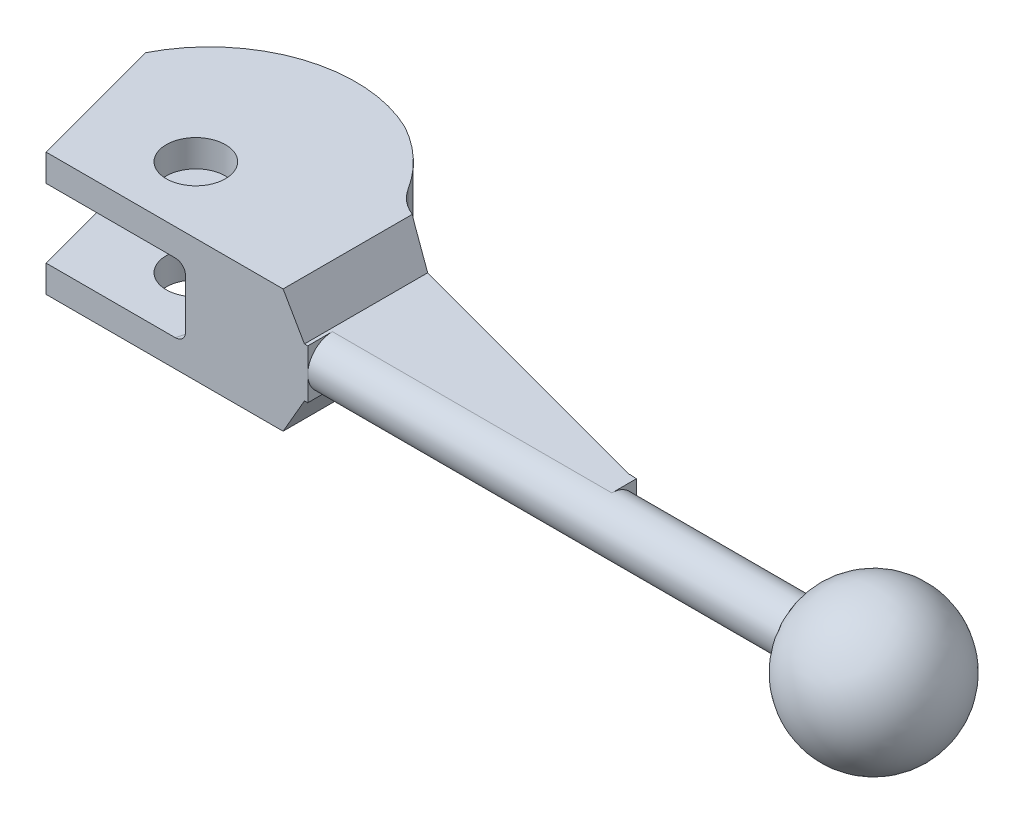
ISO-10303-21;
HEADER;
FILE_DESCRIPTION(('STEP AP214'),'2;1');
FILE_NAME('part.step','',(''),(''),'','','');
FILE_SCHEMA(('AUTOMOTIVE_DESIGN { 1 0 10303 214 1 1 1 1 }'));
ENDSEC;
DATA;
#1=APPLICATION_CONTEXT('core data for automotive mechanical design processes');
#2=APPLICATION_PROTOCOL_DEFINITION('international standard','automotive_design',2000,#1);
#3=PRODUCT_CONTEXT('',#1,'mechanical');
#4=PRODUCT('Part','Part','',(#3));
#5=PRODUCT_RELATED_PRODUCT_CATEGORY('part','',(#4));
#6=PRODUCT_DEFINITION_FORMATION('','',#4);
#7=PRODUCT_DEFINITION_CONTEXT('part definition',#1,'design');
#8=PRODUCT_DEFINITION('design','',#6,#7);
#9=PRODUCT_DEFINITION_SHAPE('','',#8);
#10=(LENGTH_UNIT() NAMED_UNIT(*) SI_UNIT(.MILLI.,.METRE.));
#11=(NAMED_UNIT(*) PLANE_ANGLE_UNIT() SI_UNIT($,.RADIAN.));
#12=(NAMED_UNIT(*) SI_UNIT($,.STERADIAN.) SOLID_ANGLE_UNIT());
#13=UNCERTAINTY_MEASURE_WITH_UNIT(LENGTH_MEASURE(1.E-05),#10,'distance_accuracy_value','');
#14=(GEOMETRIC_REPRESENTATION_CONTEXT(3) GLOBAL_UNCERTAINTY_ASSIGNED_CONTEXT((#13)) GLOBAL_UNIT_ASSIGNED_CONTEXT((#10,
#11,#12)) REPRESENTATION_CONTEXT('',''));
#15=CARTESIAN_POINT('',(0.,0.,0.));
#16=DIRECTION('',(0.,0.,1.));
#17=DIRECTION('',(1.,0.,0.));
#18=AXIS2_PLACEMENT_3D('',#15,#16,#17);
#19=CARTESIAN_POINT('',(-1.40946282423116E-13,-12.5,0.));
#20=DIRECTION('',(0.,-1.,0.));
#21=DIRECTION('',(1.,0.,0.));
#22=AXIS2_PLACEMENT_3D('',#19,#20,#21);
#23=CYLINDRICAL_SURFACE('',#22,6.);
#24=CARTESIAN_POINT('',(0.,-7.,0.));
#25=DIRECTION('',(0.,-1.,0.));
#26=DIRECTION('',(1.,0.,0.));
#27=AXIS2_PLACEMENT_3D('',#24,#25,#26);
#28=CIRCLE('',#27,6.);
#29=CARTESIAN_POINT('',(5.99999999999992,-7.00000000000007,0.));
#30=VERTEX_POINT('',#29);
#31=EDGE_CURVE('E198',#30,#30,#28,.T.);
#32=ORIENTED_EDGE('',*,*,#31,.F.);
#33=EDGE_LOOP('',(#32));
#34=FACE_BOUND('',#33,.T.);
#35=CARTESIAN_POINT('',(-1.40946282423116E-13,-12.5,0.));
#36=DIRECTION('',(0.,-1.,0.));
#37=DIRECTION('',(1.,0.,0.));
#38=AXIS2_PLACEMENT_3D('',#35,#36,#37);
#39=CIRCLE('',#38,6.);
#40=CARTESIAN_POINT('',(5.99999999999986,-12.5000000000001,0.));
#41=VERTEX_POINT('',#40);
#42=EDGE_CURVE('E17',#41,#41,#39,.F.);
#43=ORIENTED_EDGE('',*,*,#42,.F.);
#44=EDGE_LOOP('',(#43));
#45=FACE_BOUND('',#44,.T.);
#46=ADVANCED_FACE('F14',(#34,#45),#23,.F.);
#47=CARTESIAN_POINT('',(2.19999999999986,-12.5,-0.55000000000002));
#48=DIRECTION('',(0.,-1.,0.));
#49=DIRECTION('',(1.,0.,0.));
#50=AXIS2_PLACEMENT_3D('',#47,#48,#49);
#51=CYLINDRICAL_SURFACE('',#50,29.7);
#52=CARTESIAN_POINT('',(2.19999999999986,-12.5,-0.55000000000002));
#53=DIRECTION('',(0.,-1.,0.));
#54=DIRECTION('',(1.,0.,0.));
#55=AXIS2_PLACEMENT_3D('',#52,#53,#54);
#56=CIRCLE('',#55,29.7);
#57=CARTESIAN_POINT('',(-24.27,-12.4999999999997,-14.0195619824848));
#58=VERTEX_POINT('',#57);
#59=CARTESIAN_POINT('',(15.1051904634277,-12.5000000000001,-27.2996926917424));
#60=VERTEX_POINT('',#59);
#61=EDGE_CURVE('E187',#58,#60,#56,.T.);
#62=ORIENTED_EDGE('',*,*,#61,.F.);
#63=DIRECTION('',(0.,-1.,0.));
#64=VECTOR('',#63,1.);
#65=CARTESIAN_POINT('',(-24.27,-12.4999999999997,-14.0195619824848));
#66=LINE('',#65,#64);
#67=CARTESIAN_POINT('',(-24.27,-6.9999999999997,-14.0195619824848));
#68=VERTEX_POINT('',#67);
#69=EDGE_CURVE('E191',#68,#58,#66,.T.);
#70=ORIENTED_EDGE('',*,*,#69,.F.);
#71=CARTESIAN_POINT('',(2.19999999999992,-7.,-0.55000000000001));
#72=DIRECTION('',(0.,-1.,0.));
#73=DIRECTION('',(1.,0.,0.));
#74=AXIS2_PLACEMENT_3D('',#71,#72,#73);
#75=CIRCLE('',#74,29.7);
#76=CARTESIAN_POINT('',(15.1051904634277,-7.00000000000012,-27.2996926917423));
#77=VERTEX_POINT('',#76);
#78=EDGE_CURVE('E204',#77,#68,#75,.F.);
#79=ORIENTED_EDGE('',*,*,#78,.F.);
#80=DIRECTION('',(0.,-1.,0.));
#81=VECTOR('',#80,1.);
#82=CARTESIAN_POINT('',(15.1051904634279,-12.5000000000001,-27.2996926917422));
#83=LINE('',#82,#81);
#84=EDGE_CURVE('E177',#60,#77,#83,.F.);
#85=ORIENTED_EDGE('',*,*,#84,.F.);
#86=EDGE_LOOP('',(#62,#70,#79,#85));
#87=FACE_BOUND('',#86,.T.);
#88=ADVANCED_FACE('F241',(#87),#51,.T.);
#89=CARTESIAN_POINT('',(-1.40946282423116E-13,-12.5,0.));
#90=DIRECTION('',(0.,-1.,0.));
#91=DIRECTION('',(1.,0.,0.));
#92=AXIS2_PLACEMENT_3D('',#89,#90,#91);
#93=CYLINDRICAL_SURFACE('',#92,6.);
#94=CARTESIAN_POINT('',(0.,7.,0.));
#95=DIRECTION('',(0.,-1.,0.));
#96=DIRECTION('',(1.,0.,0.));
#97=AXIS2_PLACEMENT_3D('',#94,#95,#96);
#98=CIRCLE('',#97,6.);
#99=CARTESIAN_POINT('',(6.00000000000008,6.99999999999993,0.));
#100=VERTEX_POINT('',#99);
#101=EDGE_CURVE('E421',#100,#100,#98,.F.);
#102=ORIENTED_EDGE('',*,*,#101,.F.);
#103=EDGE_LOOP('',(#102));
#104=FACE_BOUND('',#103,.T.);
#105=CARTESIAN_POINT('',(1.40946282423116E-13,12.5,0.));
#106=DIRECTION('',(0.,-1.,0.));
#107=DIRECTION('',(1.,0.,0.));
#108=AXIS2_PLACEMENT_3D('',#105,#106,#107);
#109=CIRCLE('',#108,6.);
#110=CARTESIAN_POINT('',(6.00000000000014,12.4999999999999,0.));
#111=VERTEX_POINT('',#110);
#112=EDGE_CURVE('E339',#111,#111,#109,.F.);
#113=ORIENTED_EDGE('',*,*,#112,.T.);
#114=EDGE_LOOP('',(#113));
#115=FACE_BOUND('',#114,.T.);
#116=ADVANCED_FACE('F238',(#104,#115),#93,.F.);
#117=CARTESIAN_POINT('',(2.19999999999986,-12.5,-0.55000000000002));
#118=DIRECTION('',(0.,-1.,0.));
#119=DIRECTION('',(1.,0.,0.));
#120=AXIS2_PLACEMENT_3D('',#117,#118,#119);
#121=CYLINDRICAL_SURFACE('',#120,29.7);
#122=CARTESIAN_POINT('',(2.20000000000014,12.5,-0.549999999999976));
#123=DIRECTION('',(0.,-1.,0.));
#124=DIRECTION('',(1.,0.,0.));
#125=AXIS2_PLACEMENT_3D('',#122,#123,#124);
#126=CIRCLE('',#125,29.7);
#127=CARTESIAN_POINT('',(-24.27,12.5000000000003,-14.0195619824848));
#128=VERTEX_POINT('',#127);
#129=CARTESIAN_POINT('',(15.1051904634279,12.4999999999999,-27.2996926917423));
#130=VERTEX_POINT('',#129);
#131=EDGE_CURVE('E338',#128,#130,#126,.T.);
#132=ORIENTED_EDGE('',*,*,#131,.T.);
#133=DIRECTION('',(0.,-1.,0.));
#134=VECTOR('',#133,1.);
#135=CARTESIAN_POINT('',(15.1051904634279,-12.5000000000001,-27.2996926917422));
#136=LINE('',#135,#134);
#137=CARTESIAN_POINT('',(15.1051904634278,6.99999999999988,-27.2996926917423));
#138=VERTEX_POINT('',#137);
#139=EDGE_CURVE('E379',#138,#130,#136,.F.);
#140=ORIENTED_EDGE('',*,*,#139,.F.);
#141=CARTESIAN_POINT('',(2.20000000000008,7.,-0.549999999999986));
#142=DIRECTION('',(0.,-1.,0.));
#143=DIRECTION('',(1.,0.,0.));
#144=AXIS2_PLACEMENT_3D('',#141,#142,#143);
#145=CIRCLE('',#144,29.7);
#146=CARTESIAN_POINT('',(-24.27,7.0000000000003,-14.0195619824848));
#147=VERTEX_POINT('',#146);
#148=EDGE_CURVE('E419',#147,#138,#145,.T.);
#149=ORIENTED_EDGE('',*,*,#148,.F.);
#150=DIRECTION('',(0.,-1.,0.));
#151=VECTOR('',#150,1.);
#152=CARTESIAN_POINT('',(-24.27,-12.4999999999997,-14.0195619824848));
#153=LINE('',#152,#151);
#154=EDGE_CURVE('E344',#128,#147,#153,.T.);
#155=ORIENTED_EDGE('',*,*,#154,.F.);
#156=EDGE_LOOP('',(#132,#140,#149,#155));
#157=FACE_BOUND('',#156,.T.);
#158=ADVANCED_FACE('F233',(#157),#121,.T.);
#159=CARTESIAN_POINT('',(-2.31151903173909E-13,-12.5,0.));
#160=DIRECTION('',(0.,-1.,0.));
#161=DIRECTION('',(1.,0.,0.));
#162=AXIS2_PLACEMENT_3D('',#159,#160,#161);
#163=CYLINDRICAL_SURFACE('',#162,31.2);
#164=DIRECTION('',(0.,-1.,0.));
#165=VECTOR('',#164,1.);
#166=CARTESIAN_POINT('',(21.1560318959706,-5.0000000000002,-22.9316879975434));
#167=LINE('',#166,#165);
#168=CARTESIAN_POINT('',(21.1560318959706,4.9999999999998,-22.9316879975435));
#169=VERTEX_POINT('',#168);
#170=CARTESIAN_POINT('',(21.1560318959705,-5.0000000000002,-22.9316879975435));
#171=VERTEX_POINT('',#170);
#172=EDGE_CURVE('E216',#169,#171,#167,.T.);
#173=ORIENTED_EDGE('',*,*,#172,.F.);
#174=CARTESIAN_POINT('',(21.1560318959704,4.9999999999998,-22.9316879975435));
#175=CARTESIAN_POINT('',(21.1560385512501,5.05183249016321,-22.9316804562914));
#176=CARTESIAN_POINT('',(21.1543594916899,5.1036599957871,-22.9332308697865));
#177=CARTESIAN_POINT('',(21.147681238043,5.20690174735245,-22.9393900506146));
#178=CARTESIAN_POINT('',(21.1426831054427,5.25831612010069,-22.9439978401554));
#179=CARTESIAN_POINT('',(21.1294444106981,5.36015831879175,-22.9561899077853));
#180=CARTESIAN_POINT('',(21.1212168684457,5.41058926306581,-22.9637622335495));
#181=CARTESIAN_POINT('',(21.1016214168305,5.51030443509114,-22.9817699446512));
#182=CARTESIAN_POINT('',(21.0902533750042,5.55958861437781,-22.992205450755));
#183=CARTESIAN_POINT('',(21.0516309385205,5.70513129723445,-23.0275935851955));
#184=CARTESIAN_POINT('',(21.0198346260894,5.79925819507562,-23.0566497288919));
#185=CARTESIAN_POINT('',(20.9453858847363,5.97941643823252,-23.1243016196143));
#186=CARTESIAN_POINT('',(20.902724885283,6.0654413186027,-23.1629048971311));
#187=CARTESIAN_POINT('',(20.8055990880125,6.23180120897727,-23.2501936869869));
#188=CARTESIAN_POINT('',(20.7506538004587,6.31164241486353,-23.2992842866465));
#189=CARTESIAN_POINT('',(20.6320026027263,6.45929734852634,-23.4044173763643));
#190=CARTESIAN_POINT('',(20.5682939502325,6.52710729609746,-23.4604620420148));
#191=CARTESIAN_POINT('',(20.426426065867,6.65642617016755,-23.5841233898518));
#192=CARTESIAN_POINT('',(20.3474494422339,6.71646878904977,-23.6523362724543));
#193=CARTESIAN_POINT('',(20.182685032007,6.81986067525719,-23.7930871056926));
#194=CARTESIAN_POINT('',(20.0968938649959,6.86320159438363,-23.8656271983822));
#195=CARTESIAN_POINT('',(19.9226868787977,6.93166799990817,-24.0112270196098));
#196=CARTESIAN_POINT('',(19.8343898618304,6.95722077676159,-24.0842286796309));
#197=CARTESIAN_POINT('',(19.6551473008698,6.99138834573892,-24.230742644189));
#198=CARTESIAN_POINT('',(19.5642046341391,7.0000208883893,-24.3042543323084));
#199=CARTESIAN_POINT('',(19.4728125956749,6.99999999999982,-24.3772346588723));
#200=B_SPLINE_CURVE_WITH_KNOTS('',3,(#174,#175,#176,#177,#178,#179,#180,#181,#182,#183,#184,
#185,#186,#187,#188,#189,#190,#191,#192,#193,#194,#195,#196,#197,#198,#199),.UNSPECIFIED.,.F.,
.F.,(4,2,2,2,2,2,2,2,2,2,2,2,4),(0.,0.155438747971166,0.310827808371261,0.465596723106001,
0.620372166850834,0.92938655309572,1.23864546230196,1.56324256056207,1.88794146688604,
2.24762815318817,2.60749439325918,2.95838656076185,3.3089104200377),.UNSPECIFIED.);
#201=CARTESIAN_POINT('',(19.4728125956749,6.99999999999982,-24.3772346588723));
#202=VERTEX_POINT('',#201);
#203=EDGE_CURVE('E218',#169,#202,#200,.T.);
#204=ORIENTED_EDGE('',*,*,#203,.T.);
#205=CARTESIAN_POINT('',(0.,7.,1.196959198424E-13));
#206=DIRECTION('',(0.,-1.,0.));
#207=DIRECTION('',(1.,0.,0.));
#208=AXIS2_PLACEMENT_3D('',#205,#206,#207);
#209=CIRCLE('',#208,31.2);
#210=EDGE_CURVE('E348',#138,#202,#209,.T.);
#211=ORIENTED_EDGE('',*,*,#210,.F.);
#212=ORIENTED_EDGE('',*,*,#139,.T.);
#213=CARTESIAN_POINT('',(0.,12.5,1.29236898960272E-13));
#214=DIRECTION('',(0.,-1.,0.));
#215=DIRECTION('',(1.,0.,0.));
#216=AXIS2_PLACEMENT_3D('',#213,#214,#215);
#217=CIRCLE('',#216,31.2);
#218=CARTESIAN_POINT('',(26.3585970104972,12.4999999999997,-16.6932430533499));
#219=VERTEX_POINT('',#218);
#220=EDGE_CURVE('E173',#130,#219,#217,.T.);
#221=ORIENTED_EDGE('',*,*,#220,.T.);
#222=DIRECTION('',(0.,-1.,0.));
#223=VECTOR('',#222,1.);
#224=CARTESIAN_POINT('',(26.358597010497,-12.5000000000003,-16.6932430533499));
#225=LINE('',#224,#223);
#226=CARTESIAN_POINT('',(26.358597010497,-12.5000000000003,-16.6932430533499));
#227=VERTEX_POINT('',#226);
#228=EDGE_CURVE('E165',#219,#227,#225,.T.);
#229=ORIENTED_EDGE('',*,*,#228,.T.);
#230=CARTESIAN_POINT('',(-2.31151903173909E-13,-12.5,0.));
#231=DIRECTION('',(0.,-1.,0.));
#232=DIRECTION('',(1.,0.,0.));
#233=AXIS2_PLACEMENT_3D('',#230,#231,#232);
#234=CIRCLE('',#233,31.2);
#235=EDGE_CURVE('E169',#60,#227,#234,.T.);
#236=ORIENTED_EDGE('',*,*,#235,.F.);
#237=ORIENTED_EDGE('',*,*,#84,.T.);
#238=CARTESIAN_POINT('',(-1.69135538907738E-13,-7.,0.));
#239=DIRECTION('',(0.,-1.,0.));
#240=DIRECTION('',(1.,0.,0.));
#241=AXIS2_PLACEMENT_3D('',#238,#239,#240);
#242=CIRCLE('',#241,31.2);
#243=CARTESIAN_POINT('',(19.4728125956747,-7.00000000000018,-24.3772346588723));
#244=VERTEX_POINT('',#243);
#245=EDGE_CURVE('E201',#244,#77,#242,.F.);
#246=ORIENTED_EDGE('',*,*,#245,.F.);
#247=CARTESIAN_POINT('',(19.4728125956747,-7.00000000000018,-24.3772346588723));
#248=CARTESIAN_POINT('',(19.5773904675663,-7.00003593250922,-24.2937387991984));
#249=CARTESIAN_POINT('',(19.6813743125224,-6.98872538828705,-24.2095323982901));
#250=CARTESIAN_POINT('',(19.8855567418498,-6.94404516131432,-24.0420786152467));
#251=CARTESIAN_POINT('',(19.9857496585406,-6.91064372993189,-23.9588327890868));
#252=CARTESIAN_POINT('',(20.179502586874,-6.82238887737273,-23.795879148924));
#253=CARTESIAN_POINT('',(20.2730579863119,-6.76752070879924,-23.7161738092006));
#254=CARTESIAN_POINT('',(20.4506761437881,-6.6373144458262,-23.5631819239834));
#255=CARTESIAN_POINT('',(20.5347439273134,-6.56198726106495,-23.4898919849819));
#256=CARTESIAN_POINT('',(20.6879178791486,-6.39507384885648,-23.3550881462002));
#257=CARTESIAN_POINT('',(20.757430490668,-6.30411586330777,-23.2932623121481));
#258=CARTESIAN_POINT('',(20.8821061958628,-6.10633503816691,-23.1815586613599));
#259=CARTESIAN_POINT('',(20.9372749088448,-5.99951843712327,-23.1316761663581));
#260=CARTESIAN_POINT('',(21.0257578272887,-5.78448698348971,-23.0512634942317));
#261=CARTESIAN_POINT('',(21.0607163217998,-5.67750247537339,-23.0192877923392));
#262=CARTESIAN_POINT('',(21.1014015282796,-5.51198880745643,-22.9819750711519));
#263=CARTESIAN_POINT('',(21.1130015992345,-5.45600776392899,-22.9713153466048));
#264=CARTESIAN_POINT('',(21.1321610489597,-5.3427974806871,-22.9536912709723));
#265=CARTESIAN_POINT('',(21.1397229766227,-5.28556905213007,-22.9467245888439));
#266=CARTESIAN_POINT('',(21.1488120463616,-5.19017113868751,-22.9383471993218));
#267=CARTESIAN_POINT('',(21.1515196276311,-5.15220114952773,-22.9358502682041));
#268=CARTESIAN_POINT('',(21.1551288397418,-5.0761562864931,-22.9325211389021));
#269=CARTESIAN_POINT('',(21.1560329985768,-5.03808163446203,-22.9316866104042));
#270=CARTESIAN_POINT('',(21.1560318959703,-5.0000000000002,-22.9316879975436));
#271=B_SPLINE_CURVE_WITH_KNOTS('',3,(#247,#248,#249,#250,#251,#252,#253,#254,#255,#256,#257,
#258,#259,#260,#261,#262,#263,#264,#265,#266,#267,#268,#269,#270),.UNSPECIFIED.,.F.,.F.,(4,2,2,
2,2,2,2,2,2,2,2,4),(0.,0.400967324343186,0.802512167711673,1.20433335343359,1.60594068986,
1.994112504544,2.38213202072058,2.7309702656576,2.90521275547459,3.07934513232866,
3.19371696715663,3.30792836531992),.UNSPECIFIED.);
#272=EDGE_CURVE('E208',#244,#171,#271,.T.);
#273=ORIENTED_EDGE('',*,*,#272,.T.);
#274=EDGE_LOOP('',(#173,#204,#211,#212,#221,#229,#236,#237,#246,#273));
#275=FACE_BOUND('',#274,.T.);
#276=ADVANCED_FACE('F167',(#275),#163,.T.);
#277=CARTESIAN_POINT('',(34.8068652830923,-12.5000000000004,-22.0436414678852));
#278=DIRECTION('',(0.,-1.,0.));
#279=DIRECTION('',(1.,0.,0.));
#280=AXIS2_PLACEMENT_3D('',#277,#278,#279);
#281=CYLINDRICAL_SURFACE('',#280,10.);
#282=CARTESIAN_POINT('',(34.8068652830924,-6.25272607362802,-22.0436414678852));
#283=DIRECTION('',(0.866025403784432,-0.500000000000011,0.));
#284=DIRECTION('',(-0.500000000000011,-0.866025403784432,0.));
#285=AXIS2_PLACEMENT_3D('',#282,#283,#284);
#286=ELLIPSE('',#285,20.,10.);
#287=CARTESIAN_POINT('',(31.2,-12.5000000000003,-12.7167704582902));
#288=VERTEX_POINT('',#287);
#289=CARTESIAN_POINT('',(32.218674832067,-10.7356034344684,-12.3843832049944));
#290=VERTEX_POINT('',#289);
#291=EDGE_CURVE('E184',#288,#290,#286,.F.);
#292=ORIENTED_EDGE('',*,*,#291,.F.);
#293=CARTESIAN_POINT('',(34.8068652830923,-12.5000000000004,-22.0436414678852));
#294=DIRECTION('',(0.,-1.,0.));
#295=DIRECTION('',(1.,0.,0.));
#296=AXIS2_PLACEMENT_3D('',#293,#294,#295);
#297=CIRCLE('',#296,10.);
#298=EDGE_CURVE('E181',#227,#288,#297,.F.);
#299=ORIENTED_EDGE('',*,*,#298,.F.);
#300=ORIENTED_EDGE('',*,*,#228,.F.);
#301=CARTESIAN_POINT('',(34.8068652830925,12.4999999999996,-22.0436414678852));
#302=DIRECTION('',(0.,-1.,0.));
#303=DIRECTION('',(1.,0.,0.));
#304=AXIS2_PLACEMENT_3D('',#301,#302,#303);
#305=CIRCLE('',#304,10.);
#306=CARTESIAN_POINT('',(31.2,12.4999999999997,-12.7167704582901));
#307=VERTEX_POINT('',#306);
#308=EDGE_CURVE('E321',#219,#307,#305,.F.);
#309=ORIENTED_EDGE('',*,*,#308,.T.);
#310=CARTESIAN_POINT('',(34.8068652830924,6.2527260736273,-22.0436414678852));
#311=DIRECTION('',(0.866025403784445,0.49999999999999,0.));
#312=DIRECTION('',(0.49999999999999,-0.866025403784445,0.));
#313=AXIS2_PLACEMENT_3D('',#310,#311,#312);
#314=ELLIPSE('',#313,20.,10.);
#315=CARTESIAN_POINT('',(32.2186748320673,10.7356034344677,-12.3843832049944));
#316=VERTEX_POINT('',#315);
#317=EDGE_CURVE('E312',#316,#307,#314,.F.);
#318=ORIENTED_EDGE('',*,*,#317,.F.);
#319=DIRECTION('',(0.,-1.,0.));
#320=VECTOR('',#319,1.);
#321=CARTESIAN_POINT('',(32.218674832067,-12.5000000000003,-12.3843832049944));
#322=LINE('',#321,#320);
#323=EDGE_CURVE('E363',#290,#316,#322,.F.);
#324=ORIENTED_EDGE('',*,*,#323,.F.);
#325=EDGE_LOOP('',(#292,#299,#300,#309,#318,#324));
#326=FACE_BOUND('',#325,.T.);
#327=ADVANCED_FACE('F182',(#326),#281,.F.);
#328=CARTESIAN_POINT('',(91.5,-12.5000000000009,-47.7));
#329=DIRECTION('',(-1.,0.,0.));
#330=DIRECTION('',(0.,0.,-1.));
#331=AXIS2_PLACEMENT_3D('',#328,#329,#330);
#332=PLANE('',#331);
#333=DIRECTION('',(0.,0.,-1.));
#334=VECTOR('',#333,1.);
#335=CARTESIAN_POINT('',(91.5,-5.00000000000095,-47.7));
#336=LINE('',#335,#334);
#337=CARTESIAN_POINT('',(91.5,-5.00000000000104,3.40074882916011));
#338=VERTEX_POINT('',#337);
#339=CARTESIAN_POINT('',(91.5,-5.00000000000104,3.5));
#340=VERTEX_POINT('',#339);
#341=EDGE_CURVE('E375',#338,#340,#336,.F.);
#342=ORIENTED_EDGE('',*,*,#341,.T.);
#343=DIRECTION('',(0.,-1.,0.));
#344=VECTOR('',#343,1.);
#345=CARTESIAN_POINT('',(91.5,-12.500000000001,3.5));
#346=LINE('',#345,#344);
#347=CARTESIAN_POINT('',(91.5,4.99999999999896,3.5));
#348=VERTEX_POINT('',#347);
#349=EDGE_CURVE('E326',#348,#340,#346,.T.);
#350=ORIENTED_EDGE('',*,*,#349,.F.);
#351=DIRECTION('',(0.,0.,-1.));
#352=VECTOR('',#351,1.);
#353=CARTESIAN_POINT('',(91.5,4.99999999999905,-47.7));
#354=LINE('',#353,#352);
#355=CARTESIAN_POINT('',(91.5,4.99999999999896,3.40074882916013));
#356=VERTEX_POINT('',#355);
#357=EDGE_CURVE('E176',#348,#356,#354,.T.);
#358=ORIENTED_EDGE('',*,*,#357,.T.);
#359=DIRECTION('',(0.,-1.,0.));
#360=VECTOR('',#359,1.);
#361=CARTESIAN_POINT('',(91.5,-5.00000000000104,3.40074882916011));
#362=LINE('',#361,#360);
#363=EDGE_CURVE('E330',#356,#338,#362,.T.);
#364=ORIENTED_EDGE('',*,*,#363,.T.);
#365=EDGE_LOOP('',(#342,#350,#358,#364));
#366=FACE_BOUND('',#365,.T.);
#367=ADVANCED_FACE('F503',(#366),#332,.T.);
#368=CARTESIAN_POINT('',(-1.40946282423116E-13,-12.5,0.));
#369=DIRECTION('',(0.,-1.,0.));
#370=DIRECTION('',(1.,0.,0.));
#371=AXIS2_PLACEMENT_3D('',#368,#369,#370);
#372=PLANE('',#371);
#373=ORIENTED_EDGE('',*,*,#61,.T.);
#374=ORIENTED_EDGE('',*,*,#235,.T.);
#375=ORIENTED_EDGE('',*,*,#298,.T.);
#376=DIRECTION('',(0.,0.,1.));
#377=VECTOR('',#376,1.);
#378=CARTESIAN_POINT('',(31.2,-12.5000000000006,146.));
#379=LINE('',#378,#377);
#380=CARTESIAN_POINT('',(31.2,-12.5000000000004,13.5));
#381=VERTEX_POINT('',#380);
#382=EDGE_CURVE('E319',#381,#288,#379,.F.);
#383=ORIENTED_EDGE('',*,*,#382,.F.);
#384=DIRECTION('',(1.,0.,0.));
#385=VECTOR('',#384,1.);
#386=CARTESIAN_POINT('',(38.2,-12.5000000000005,13.5));
#387=LINE('',#386,#385);
#388=CARTESIAN_POINT('',(-16.8961555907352,-12.4999999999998,13.5));
#389=VERTEX_POINT('',#388);
#390=EDGE_CURVE('E325',#381,#389,#387,.F.);
#391=ORIENTED_EDGE('',*,*,#390,.T.);
#392=DIRECTION('',(-0.258819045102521,0.,-0.965925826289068));
#393=VECTOR('',#392,1.);
#394=CARTESIAN_POINT('',(-24.27,-12.4999999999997,-14.0195619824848));
#395=LINE('',#394,#393);
#396=EDGE_CURVE('E194',#58,#389,#395,.F.);
#397=ORIENTED_EDGE('',*,*,#396,.F.);
#398=EDGE_LOOP('',(#373,#374,#375,#383,#391,#397));
#399=FACE_BOUND('',#398,.T.);
#400=ORIENTED_EDGE('',*,*,#42,.T.);
#401=EDGE_LOOP('',(#400));
#402=FACE_BOUND('',#401,.T.);
#403=ADVANCED_FACE('F188',(#399,#402),#372,.T.);
#404=CARTESIAN_POINT('',(-24.27,-12.4999999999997,-14.0195619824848));
#405=DIRECTION('',(-0.965925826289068,0.,0.258819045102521));
#406=DIRECTION('',(-0.258819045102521,0.,-0.965925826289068));
#407=AXIS2_PLACEMENT_3D('',#404,#405,#406);
#408=PLANE('',#407);
#409=ORIENTED_EDGE('',*,*,#69,.T.);
#410=ORIENTED_EDGE('',*,*,#396,.T.);
#411=DIRECTION('',(0.,1.,0.));
#412=VECTOR('',#411,1.);
#413=CARTESIAN_POINT('',(-16.8961555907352,-12.4999999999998,13.5));
#414=LINE('',#413,#412);
#415=CARTESIAN_POINT('',(-16.8961555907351,-6.99999999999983,13.5));
#416=VERTEX_POINT('',#415);
#417=EDGE_CURVE('E302',#389,#416,#414,.T.);
#418=ORIENTED_EDGE('',*,*,#417,.T.);
#419=DIRECTION('',(0.258819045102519,0.,0.965925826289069));
#420=VECTOR('',#419,1.);
#421=CARTESIAN_POINT('',(-24.27,-6.9999999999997,-14.0195619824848));
#422=LINE('',#421,#420);
#423=EDGE_CURVE('E207',#68,#416,#422,.T.);
#424=ORIENTED_EDGE('',*,*,#423,.F.);
#425=EDGE_LOOP('',(#409,#410,#418,#424));
#426=FACE_BOUND('',#425,.T.);
#427=ADVANCED_FACE('F457',(#426),#408,.T.);
#428=CARTESIAN_POINT('',(-164.806826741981,-6.99999999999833,106.990466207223));
#429=DIRECTION('',(0.,1.,0.));
#430=DIRECTION('',(-1.,0.,0.));
#431=AXIS2_PLACEMENT_3D('',#428,#429,#430);
#432=PLANE('',#431);
#433=ORIENTED_EDGE('',*,*,#78,.T.);
#434=ORIENTED_EDGE('',*,*,#423,.T.);
#435=DIRECTION('',(1.,0.,0.));
#436=VECTOR('',#435,1.);
#437=CARTESIAN_POINT('',(38.2,-7.00000000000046,13.5));
#438=LINE('',#437,#436);
#439=CARTESIAN_POINT('',(9.32363815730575,-7.00000000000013,13.5));
#440=VERTEX_POINT('',#439);
#441=EDGE_CURVE('E300',#416,#440,#438,.T.);
#442=ORIENTED_EDGE('',*,*,#441,.T.);
#443=DIRECTION('',(-0.258819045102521,0.,0.965925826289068));
#444=VECTOR('',#443,1.);
#445=CARTESIAN_POINT('',(-25.7135077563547,-7.,144.260408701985));
#446=LINE('',#445,#444);
#447=EDGE_CURVE('E217',#440,#244,#446,.F.);
#448=ORIENTED_EDGE('',*,*,#447,.T.);
#449=ORIENTED_EDGE('',*,*,#245,.T.);
#450=EDGE_LOOP('',(#433,#434,#442,#448,#449));
#451=FACE_BOUND('',#450,.T.);
#452=ORIENTED_EDGE('',*,*,#31,.T.);
#453=EDGE_LOOP('',(#452));
#454=FACE_BOUND('',#453,.T.);
#455=ADVANCED_FACE('F465',(#451,#454),#432,.T.);
#456=CARTESIAN_POINT('',(-25.7135077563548,-5.,144.260408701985));
#457=DIRECTION('',(-0.258819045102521,0.,0.965925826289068));
#458=DIRECTION('',(-0.965925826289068,0.,-0.258819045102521));
#459=AXIS2_PLACEMENT_3D('',#456,#457,#458);
#460=CYLINDRICAL_SURFACE('',#459,2.);
#461=DIRECTION('',(0.258819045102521,0.,-0.965925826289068));
#462=VECTOR('',#461,1.);
#463=CARTESIAN_POINT('',(-23.7816561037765,-5.,144.778046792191));
#464=LINE('',#463,#462);
#465=CARTESIAN_POINT('',(11.394190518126,-5.00000000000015,13.5));
#466=VERTEX_POINT('',#465);
#467=EDGE_CURVE('E352',#171,#466,#464,.F.);
#468=ORIENTED_EDGE('',*,*,#467,.F.);
#469=ORIENTED_EDGE('',*,*,#272,.F.);
#470=ORIENTED_EDGE('',*,*,#447,.F.);
#471=CARTESIAN_POINT('',(9.32363815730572,-5.00000000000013,13.5));
#472=DIRECTION('',(0.,0.,-1.));
#473=DIRECTION('',(-1.,0.,0.));
#474=AXIS2_PLACEMENT_3D('',#471,#472,#473);
#475=ELLIPSE('',#474,2.07055236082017,2.);
#476=EDGE_CURVE('E299',#440,#466,#475,.F.);
#477=ORIENTED_EDGE('',*,*,#476,.T.);
#478=EDGE_LOOP('',(#468,#469,#470,#477));
#479=FACE_BOUND('',#478,.T.);
#480=ADVANCED_FACE('F225',(#479),#460,.F.);
#481=CARTESIAN_POINT('',(-23.7816561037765,-5.,144.778046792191));
#482=DIRECTION('',(-0.965925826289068,0.,-0.258819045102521));
#483=DIRECTION('',(0.258819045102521,0.,-0.965925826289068));
#484=AXIS2_PLACEMENT_3D('',#481,#482,#483);
#485=PLANE('',#484);
#486=ORIENTED_EDGE('',*,*,#172,.T.);
#487=ORIENTED_EDGE('',*,*,#467,.T.);
#488=DIRECTION('',(0.,1.,0.));
#489=VECTOR('',#488,1.);
#490=CARTESIAN_POINT('',(11.394190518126,-12.5000000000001,13.5));
#491=LINE('',#490,#489);
#492=CARTESIAN_POINT('',(11.394190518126,4.99999999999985,13.5));
#493=VERTEX_POINT('',#492);
#494=EDGE_CURVE('E297',#466,#493,#491,.T.);
#495=ORIENTED_EDGE('',*,*,#494,.T.);
#496=DIRECTION('',(-0.258819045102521,0.,0.965925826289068));
#497=VECTOR('',#496,1.);
#498=CARTESIAN_POINT('',(-23.7816561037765,5.,144.77804679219));
#499=LINE('',#498,#497);
#500=EDGE_CURVE('E349',#493,#169,#499,.F.);
#501=ORIENTED_EDGE('',*,*,#500,.T.);
#502=EDGE_LOOP('',(#486,#487,#495,#501));
#503=FACE_BOUND('',#502,.T.);
#504=ADVANCED_FACE('F472',(#503),#485,.T.);
#505=CARTESIAN_POINT('',(-25.7135077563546,5.,144.260408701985));
#506=DIRECTION('',(-0.258819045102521,0.,0.965925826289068));
#507=DIRECTION('',(-0.965925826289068,0.,-0.258819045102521));
#508=AXIS2_PLACEMENT_3D('',#505,#506,#507);
#509=CYLINDRICAL_SURFACE('',#508,2.);
#510=DIRECTION('',(-0.258819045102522,0.,0.965925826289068));
#511=VECTOR('',#510,1.);
#512=CARTESIAN_POINT('',(19.472812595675,6.99999999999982,-24.3772346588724));
#513=LINE('',#512,#511);
#514=CARTESIAN_POINT('',(9.32363815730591,6.99999999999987,13.5));
#515=VERTEX_POINT('',#514);
#516=EDGE_CURVE('E345',#202,#515,#513,.T.);
#517=ORIENTED_EDGE('',*,*,#516,.F.);
#518=ORIENTED_EDGE('',*,*,#203,.F.);
#519=ORIENTED_EDGE('',*,*,#500,.F.);
#520=CARTESIAN_POINT('',(9.32363815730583,4.99999999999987,13.5));
#521=DIRECTION('',(0.,0.,-1.));
#522=DIRECTION('',(-1.,0.,0.));
#523=AXIS2_PLACEMENT_3D('',#520,#521,#522);
#524=ELLIPSE('',#523,2.07055236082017,2.);
#525=EDGE_CURVE('E296',#493,#515,#524,.F.);
#526=ORIENTED_EDGE('',*,*,#525,.T.);
#527=EDGE_LOOP('',(#517,#518,#519,#526));
#528=FACE_BOUND('',#527,.T.);
#529=ADVANCED_FACE('F430',(#528),#509,.F.);
#530=CARTESIAN_POINT('',(-25.7135077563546,7.,144.260408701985));
#531=DIRECTION('',(0.,-1.,0.));
#532=DIRECTION('',(1.,0.,0.));
#533=AXIS2_PLACEMENT_3D('',#530,#531,#532);
#534=PLANE('',#533);
#535=ORIENTED_EDGE('',*,*,#210,.T.);
#536=ORIENTED_EDGE('',*,*,#516,.T.);
#537=DIRECTION('',(1.,0.,0.));
#538=VECTOR('',#537,1.);
#539=CARTESIAN_POINT('',(38.2,6.99999999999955,13.5));
#540=LINE('',#539,#538);
#541=CARTESIAN_POINT('',(-16.8961555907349,7.00000000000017,13.5));
#542=VERTEX_POINT('',#541);
#543=EDGE_CURVE('E293',#515,#542,#540,.F.);
#544=ORIENTED_EDGE('',*,*,#543,.T.);
#545=DIRECTION('',(-0.258819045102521,0.,-0.965925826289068));
#546=VECTOR('',#545,1.);
#547=CARTESIAN_POINT('',(-24.27,7.0000000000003,-14.0195619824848));
#548=LINE('',#547,#546);
#549=EDGE_CURVE('E341',#147,#542,#548,.F.);
#550=ORIENTED_EDGE('',*,*,#549,.F.);
#551=ORIENTED_EDGE('',*,*,#148,.T.);
#552=EDGE_LOOP('',(#535,#536,#544,#550,#551));
#553=FACE_BOUND('',#552,.T.);
#554=ORIENTED_EDGE('',*,*,#101,.T.);
#555=EDGE_LOOP('',(#554));
#556=FACE_BOUND('',#555,.T.);
#557=ADVANCED_FACE('F434',(#553,#556),#534,.T.);
#558=CARTESIAN_POINT('',(-24.27,-12.4999999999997,-14.0195619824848));
#559=DIRECTION('',(-0.965925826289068,0.,0.258819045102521));
#560=DIRECTION('',(-0.258819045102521,0.,-0.965925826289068));
#561=AXIS2_PLACEMENT_3D('',#558,#559,#560);
#562=PLANE('',#561);
#563=DIRECTION('',(0.,1.,0.));
#564=VECTOR('',#563,1.);
#565=CARTESIAN_POINT('',(-16.8961555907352,-12.4999999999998,13.5));
#566=LINE('',#565,#564);
#567=CARTESIAN_POINT('',(-16.8961555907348,12.5000000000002,13.5));
#568=VERTEX_POINT('',#567);
#569=EDGE_CURVE('E295',#542,#568,#566,.T.);
#570=ORIENTED_EDGE('',*,*,#569,.T.);
#571=DIRECTION('',(-0.25881904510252,0.,-0.965925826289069));
#572=VECTOR('',#571,1.);
#573=CARTESIAN_POINT('',(-16.8961555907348,12.5000000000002,13.5));
#574=LINE('',#573,#572);
#575=EDGE_CURVE('E335',#568,#128,#574,.T.);
#576=ORIENTED_EDGE('',*,*,#575,.T.);
#577=ORIENTED_EDGE('',*,*,#154,.T.);
#578=ORIENTED_EDGE('',*,*,#549,.T.);
#579=EDGE_LOOP('',(#570,#576,#577,#578));
#580=FACE_BOUND('',#579,.T.);
#581=ADVANCED_FACE('F476',(#580),#562,.T.);
#582=CARTESIAN_POINT('',(1.40946282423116E-13,12.5,0.));
#583=DIRECTION('',(0.,-1.,0.));
#584=DIRECTION('',(1.,0.,0.));
#585=AXIS2_PLACEMENT_3D('',#582,#583,#584);
#586=PLANE('',#585);
#587=ORIENTED_EDGE('',*,*,#308,.F.);
#588=ORIENTED_EDGE('',*,*,#220,.F.);
#589=ORIENTED_EDGE('',*,*,#131,.F.);
#590=ORIENTED_EDGE('',*,*,#575,.F.);
#591=DIRECTION('',(1.,0.,0.));
#592=VECTOR('',#591,1.);
#593=CARTESIAN_POINT('',(38.2,12.4999999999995,13.5));
#594=LINE('',#593,#592);
#595=CARTESIAN_POINT('',(31.2,12.4999999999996,13.5));
#596=VERTEX_POINT('',#595);
#597=EDGE_CURVE('E316',#568,#596,#594,.T.);
#598=ORIENTED_EDGE('',*,*,#597,.T.);
#599=DIRECTION('',(0.,0.,1.));
#600=VECTOR('',#599,1.);
#601=CARTESIAN_POINT('',(31.2,12.4999999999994,146.));
#602=LINE('',#601,#600);
#603=EDGE_CURVE('E308',#307,#596,#602,.T.);
#604=ORIENTED_EDGE('',*,*,#603,.F.);
#605=EDGE_LOOP('',(#587,#588,#589,#590,#598,#604));
#606=FACE_BOUND('',#605,.T.);
#607=ORIENTED_EDGE('',*,*,#112,.F.);
#608=EDGE_LOOP('',(#607));
#609=FACE_BOUND('',#608,.T.);
#610=ADVANCED_FACE('F438',(#606,#609),#586,.F.);
#611=CARTESIAN_POINT('',(35.5301270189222,-5.00000000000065,146.));
#612=DIRECTION('',(0.866025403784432,-0.500000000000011,0.));
#613=DIRECTION('',(0.500000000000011,0.866025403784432,0.));
#614=AXIS2_PLACEMENT_3D('',#611,#612,#613);
#615=PLANE('',#614);
#616=DIRECTION('',(-0.495572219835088,-0.858356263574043,-0.13278817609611));
#617=VECTOR('',#616,1.);
#618=CARTESIAN_POINT('',(35.5301270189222,-5.00000000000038,-11.4970822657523));
#619=LINE('',#618,#617);
#620=CARTESIAN_POINT('',(35.5301270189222,-5.00000000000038,-11.4970822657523));
#621=VERTEX_POINT('',#620);
#622=EDGE_CURVE('E311',#621,#290,#619,.T.);
#623=ORIENTED_EDGE('',*,*,#622,.F.);
#624=DIRECTION('',(0.,0.,1.));
#625=VECTOR('',#624,1.);
#626=CARTESIAN_POINT('',(35.5301270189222,-5.0000000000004,1.56992474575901E-12));
#627=LINE('',#626,#625);
#628=CARTESIAN_POINT('',(35.5301270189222,-5.00000000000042,13.5));
#629=VERTEX_POINT('',#628);
#630=EDGE_CURVE('E291',#629,#621,#627,.F.);
#631=ORIENTED_EDGE('',*,*,#630,.F.);
#632=DIRECTION('',(-0.50000000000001,-0.866025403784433,0.));
#633=VECTOR('',#632,1.);
#634=CARTESIAN_POINT('',(35.5301270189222,-5.00000000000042,13.5));
#635=LINE('',#634,#633);
#636=EDGE_CURVE('E322',#629,#381,#635,.T.);
#637=ORIENTED_EDGE('',*,*,#636,.T.);
#638=ORIENTED_EDGE('',*,*,#382,.T.);
#639=ORIENTED_EDGE('',*,*,#291,.T.);
#640=EDGE_LOOP('',(#623,#631,#637,#638,#639));
#641=FACE_BOUND('',#640,.T.);
#642=ADVANCED_FACE('F452',(#641),#615,.T.);
#643=CARTESIAN_POINT('',(92.9054083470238,-5.00000000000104,-6.4999999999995));
#644=DIRECTION('',(0.,-1.,0.));
#645=DIRECTION('',(1.,0.,0.));
#646=AXIS2_PLACEMENT_3D('',#643,#644,#645);
#647=CYLINDRICAL_SURFACE('',#646,9.99999999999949);
#648=ORIENTED_EDGE('',*,*,#363,.F.);
#649=CARTESIAN_POINT('',(92.9054083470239,4.99999999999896,-6.49999999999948));
#650=DIRECTION('',(0.,-1.,0.));
#651=DIRECTION('',(1.,0.,0.));
#652=AXIS2_PLACEMENT_3D('',#649,#650,#651);
#653=CIRCLE('',#652,9.99999999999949);
#654=CARTESIAN_POINT('',(92.88,4.99999999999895,3.49996772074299));
#655=VERTEX_POINT('',#654);
#656=EDGE_CURVE('E333',#655,#356,#653,.T.);
#657=ORIENTED_EDGE('',*,*,#656,.F.);
#658=DIRECTION('',(0.,1.,0.));
#659=VECTOR('',#658,1.);
#660=CARTESIAN_POINT('',(92.88,-1.05379241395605E-12,3.49996772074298));
#661=LINE('',#660,#659);
#662=CARTESIAN_POINT('',(92.88,-5.00000000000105,3.49996772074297));
#663=VERTEX_POINT('',#662);
#664=EDGE_CURVE('E307',#663,#655,#661,.T.);
#665=ORIENTED_EDGE('',*,*,#664,.F.);
#666=CARTESIAN_POINT('',(92.9054083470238,-5.00000000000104,-6.4999999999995));
#667=DIRECTION('',(0.,-1.,0.));
#668=DIRECTION('',(1.,0.,0.));
#669=AXIS2_PLACEMENT_3D('',#666,#667,#668);
#670=CIRCLE('',#669,9.99999999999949);
#671=EDGE_CURVE('E292',#338,#663,#670,.F.);
#672=ORIENTED_EDGE('',*,*,#671,.F.);
#673=EDGE_LOOP('',(#648,#657,#665,#672));
#674=FACE_BOUND('',#673,.T.);
#675=ADVANCED_FACE('F502',(#674),#647,.F.);
#676=CARTESIAN_POINT('',(31.2,12.4999999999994,146.));
#677=DIRECTION('',(0.866025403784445,0.49999999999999,0.));
#678=DIRECTION('',(-0.49999999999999,0.866025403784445,0.));
#679=AXIS2_PLACEMENT_3D('',#676,#677,#678);
#680=PLANE('',#679);
#681=ORIENTED_EDGE('',*,*,#317,.T.);
#682=ORIENTED_EDGE('',*,*,#603,.T.);
#683=DIRECTION('',(0.499999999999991,-0.866025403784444,0.));
#684=VECTOR('',#683,1.);
#685=CARTESIAN_POINT('',(31.2,12.4999999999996,13.5));
#686=LINE('',#685,#684);
#687=CARTESIAN_POINT('',(35.5301270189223,4.99999999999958,13.5));
#688=VERTEX_POINT('',#687);
#689=EDGE_CURVE('E313',#596,#688,#686,.T.);
#690=ORIENTED_EDGE('',*,*,#689,.T.);
#691=DIRECTION('',(0.,0.,1.));
#692=VECTOR('',#691,1.);
#693=CARTESIAN_POINT('',(35.5301270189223,4.9999999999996,1.58727198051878E-12));
#694=LINE('',#693,#692);
#695=CARTESIAN_POINT('',(35.5301270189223,4.99999999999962,-11.4970822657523));
#696=VERTEX_POINT('',#695);
#697=EDGE_CURVE('E306',#688,#696,#694,.F.);
#698=ORIENTED_EDGE('',*,*,#697,.T.);
#699=DIRECTION('',(0.495572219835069,-0.858356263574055,0.132788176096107));
#700=VECTOR('',#699,1.);
#701=CARTESIAN_POINT('',(32.2186748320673,10.7356034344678,-12.3843832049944));
#702=LINE('',#701,#700);
#703=EDGE_CURVE('E366',#316,#696,#702,.T.);
#704=ORIENTED_EDGE('',*,*,#703,.F.);
#705=EDGE_LOOP('',(#681,#682,#690,#698,#704));
#706=FACE_BOUND('',#705,.T.);
#707=ADVANCED_FACE('F444',(#706),#680,.T.);
#708=CARTESIAN_POINT('',(91.5,-12.500000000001,3.5));
#709=DIRECTION('',(0.258819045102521,0.,-0.965925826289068));
#710=DIRECTION('',(0.965925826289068,0.,0.258819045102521));
#711=AXIS2_PLACEMENT_3D('',#708,#709,#710);
#712=PLANE('',#711);
#713=DIRECTION('',(0.965925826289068,0.,0.258819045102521));
#714=VECTOR('',#713,1.);
#715=CARTESIAN_POINT('',(35.5301270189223,4.99999999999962,-11.4970822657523));
#716=LINE('',#715,#714);
#717=EDGE_CURVE('E318',#696,#348,#716,.T.);
#718=ORIENTED_EDGE('',*,*,#717,.T.);
#719=ORIENTED_EDGE('',*,*,#349,.T.);
#720=DIRECTION('',(0.965925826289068,0.,0.258819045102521));
#721=VECTOR('',#720,1.);
#722=CARTESIAN_POINT('',(35.5301270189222,-5.00000000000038,-11.4970822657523));
#723=LINE('',#722,#721);
#724=EDGE_CURVE('E315',#621,#340,#723,.T.);
#725=ORIENTED_EDGE('',*,*,#724,.F.);
#726=ORIENTED_EDGE('',*,*,#622,.T.);
#727=ORIENTED_EDGE('',*,*,#323,.T.);
#728=ORIENTED_EDGE('',*,*,#703,.T.);
#729=EDGE_LOOP('',(#718,#719,#725,#726,#727,#728));
#730=FACE_BOUND('',#729,.T.);
#731=ADVANCED_FACE('F448',(#730),#712,.T.);
#732=CARTESIAN_POINT('',(38.2,-12.5000000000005,13.5));
#733=DIRECTION('',(0.,0.,-1.));
#734=DIRECTION('',(0.,1.,0.));
#735=AXIS2_PLACEMENT_3D('',#732,#733,#734);
#736=PLANE('',#735);
#737=DIRECTION('',(0.,1.,0.));
#738=VECTOR('',#737,1.);
#739=CARTESIAN_POINT('',(36.2,-4.31599200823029E-13,13.5));
#740=LINE('',#739,#738);
#741=CARTESIAN_POINT('',(36.2,-4.31446119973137E-13,13.5));
#742=VERTEX_POINT('',#741);
#743=CARTESIAN_POINT('',(36.2,-5.00000000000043,13.5));
#744=VERTEX_POINT('',#743);
#745=EDGE_CURVE('E271',#742,#744,#740,.F.);
#746=ORIENTED_EDGE('',*,*,#745,.F.);
#747=DIRECTION('',(0.,1.,0.));
#748=VECTOR('',#747,1.);
#749=CARTESIAN_POINT('',(36.2,-4.31599200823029E-13,13.5));
#750=LINE('',#749,#748);
#751=CARTESIAN_POINT('',(36.2,4.99999999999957,13.5));
#752=VERTEX_POINT('',#751);
#753=EDGE_CURVE('E274',#752,#742,#750,.F.);
#754=ORIENTED_EDGE('',*,*,#753,.F.);
#755=DIRECTION('',(1.,0.,0.));
#756=VECTOR('',#755,1.);
#757=CARTESIAN_POINT('',(-2.08080080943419E-12,5.,13.5));
#758=LINE('',#757,#756);
#759=EDGE_CURVE('E303',#752,#688,#758,.F.);
#760=ORIENTED_EDGE('',*,*,#759,.T.);
#761=ORIENTED_EDGE('',*,*,#689,.F.);
#762=ORIENTED_EDGE('',*,*,#597,.F.);
#763=ORIENTED_EDGE('',*,*,#569,.F.);
#764=ORIENTED_EDGE('',*,*,#543,.F.);
#765=ORIENTED_EDGE('',*,*,#525,.F.);
#766=ORIENTED_EDGE('',*,*,#494,.F.);
#767=ORIENTED_EDGE('',*,*,#476,.F.);
#768=ORIENTED_EDGE('',*,*,#441,.F.);
#769=ORIENTED_EDGE('',*,*,#417,.F.);
#770=ORIENTED_EDGE('',*,*,#390,.F.);
#771=ORIENTED_EDGE('',*,*,#636,.F.);
#772=DIRECTION('',(1.,0.,0.));
#773=VECTOR('',#772,1.);
#774=CARTESIAN_POINT('',(-2.19355783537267E-12,-5.,13.5));
#775=LINE('',#774,#773);
#776=EDGE_CURVE('E288',#744,#629,#775,.F.);
#777=ORIENTED_EDGE('',*,*,#776,.F.);
#778=EDGE_LOOP('',(#746,#754,#760,#761,#762,#763,#764,#765,#766,#767,#768,#769,#770,#771,#777));
#779=FACE_BOUND('',#778,.T.);
#780=ADVANCED_FACE('F460',(#779),#736,.F.);
#781=CARTESIAN_POINT('',(-2.19355783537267E-12,-5.,1.56992474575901E-12));
#782=DIRECTION('',(0.,-1.,0.));
#783=DIRECTION('',(1.,0.,0.));
#784=AXIS2_PLACEMENT_3D('',#781,#782,#783);
#785=PLANE('',#784);
#786=ORIENTED_EDGE('',*,*,#776,.T.);
#787=ORIENTED_EDGE('',*,*,#630,.T.);
#788=ORIENTED_EDGE('',*,*,#724,.T.);
#789=ORIENTED_EDGE('',*,*,#341,.F.);
#790=ORIENTED_EDGE('',*,*,#671,.T.);
#791=DIRECTION('',(0.,0.,1.));
#792=VECTOR('',#791,1.);
#793=CARTESIAN_POINT('',(92.88,-5.00000000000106,8.5));
#794=LINE('',#793,#792);
#795=CARTESIAN_POINT('',(92.88,-5.00000000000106,8.5));
#796=VERTEX_POINT('',#795);
#797=EDGE_CURVE('E329',#796,#663,#794,.F.);
#798=ORIENTED_EDGE('',*,*,#797,.F.);
#799=DIRECTION('',(1.,0.,0.));
#800=VECTOR('',#799,1.);
#801=CARTESIAN_POINT('',(182.2,-5.00000000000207,8.5));
#802=LINE('',#801,#800);
#803=CARTESIAN_POINT('',(36.2,-5.00000000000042,8.5));
#804=VERTEX_POINT('',#803);
#805=EDGE_CURVE('E270',#804,#796,#802,.T.);
#806=ORIENTED_EDGE('',*,*,#805,.F.);
#807=DIRECTION('',(0.,0.,1.));
#808=VECTOR('',#807,1.);
#809=CARTESIAN_POINT('',(36.2,-5.00000000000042,8.5));
#810=LINE('',#809,#808);
#811=EDGE_CURVE('E267',#744,#804,#810,.F.);
#812=ORIENTED_EDGE('',*,*,#811,.F.);
#813=EDGE_LOOP('',(#786,#787,#788,#789,#790,#798,#806,#812));
#814=FACE_BOUND('',#813,.T.);
#815=ADVANCED_FACE('F485',(#814),#785,.T.);
#816=CARTESIAN_POINT('',(92.88,-1.06246608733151E-12,8.5));
#817=DIRECTION('',(1.,0.,0.));
#818=DIRECTION('',(0.,1.,0.));
#819=AXIS2_PLACEMENT_3D('',#816,#817,#818);
#820=PLANE('',#819);
#821=ORIENTED_EDGE('',*,*,#797,.T.);
#822=ORIENTED_EDGE('',*,*,#664,.T.);
#823=DIRECTION('',(0.,0.,1.));
#824=VECTOR('',#823,1.);
#825=CARTESIAN_POINT('',(92.88,4.99999999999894,8.5));
#826=LINE('',#825,#824);
#827=CARTESIAN_POINT('',(92.88,4.99999999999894,8.5));
#828=VERTEX_POINT('',#827);
#829=EDGE_CURVE('E283',#655,#828,#826,.T.);
#830=ORIENTED_EDGE('',*,*,#829,.T.);
#831=CARTESIAN_POINT('',(92.88,-1.06203240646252E-12,8.5));
#832=DIRECTION('',(1.,0.,0.));
#833=DIRECTION('',(0.,1.,0.));
#834=AXIS2_PLACEMENT_3D('',#831,#832,#833);
#835=CIRCLE('',#834,5.);
#836=EDGE_CURVE('E277',#796,#828,#835,.T.);
#837=ORIENTED_EDGE('',*,*,#836,.F.);
#838=EDGE_LOOP('',(#821,#822,#830,#837));
#839=FACE_BOUND('',#838,.T.);
#840=ADVANCED_FACE('F497',(#839),#820,.T.);
#841=CARTESIAN_POINT('',(-2.08080080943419E-12,5.,1.58727198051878E-12));
#842=DIRECTION('',(0.,-1.,0.));
#843=DIRECTION('',(1.,0.,0.));
#844=AXIS2_PLACEMENT_3D('',#841,#842,#843);
#845=PLANE('',#844);
#846=ORIENTED_EDGE('',*,*,#829,.F.);
#847=ORIENTED_EDGE('',*,*,#656,.T.);
#848=ORIENTED_EDGE('',*,*,#357,.F.);
#849=ORIENTED_EDGE('',*,*,#717,.F.);
#850=ORIENTED_EDGE('',*,*,#697,.F.);
#851=ORIENTED_EDGE('',*,*,#759,.F.);
#852=DIRECTION('',(0.,0.,1.));
#853=VECTOR('',#852,1.);
#854=CARTESIAN_POINT('',(36.2,4.99999999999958,8.5));
#855=LINE('',#854,#853);
#856=CARTESIAN_POINT('',(36.2,4.99999999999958,8.5));
#857=VERTEX_POINT('',#856);
#858=EDGE_CURVE('E280',#857,#752,#855,.T.);
#859=ORIENTED_EDGE('',*,*,#858,.F.);
#860=DIRECTION('',(1.,0.,0.));
#861=VECTOR('',#860,1.);
#862=CARTESIAN_POINT('',(182.2,4.99999999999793,8.5));
#863=LINE('',#862,#861);
#864=EDGE_CURVE('E284',#828,#857,#863,.F.);
#865=ORIENTED_EDGE('',*,*,#864,.F.);
#866=EDGE_LOOP('',(#846,#847,#848,#849,#850,#851,#859,#865));
#867=FACE_BOUND('',#866,.T.);
#868=ADVANCED_FACE('F481',(#867),#845,.F.);
#869=CARTESIAN_POINT('',(36.2,-4.22925583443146E-13,8.5));
#870=DIRECTION('',(1.,0.,0.));
#871=DIRECTION('',(0.,1.,0.));
#872=AXIS2_PLACEMENT_3D('',#869,#870,#871);
#873=PLANE('',#872);
#874=ORIENTED_EDGE('',*,*,#858,.T.);
#875=ORIENTED_EDGE('',*,*,#753,.T.);
#876=CARTESIAN_POINT('',(36.2,-4.22925583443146E-13,8.5));
#877=DIRECTION('',(1.,0.,0.));
#878=DIRECTION('',(0.,1.,0.));
#879=AXIS2_PLACEMENT_3D('',#876,#877,#878);
#880=CIRCLE('',#879,5.);
#881=EDGE_CURVE('E287',#857,#742,#880,.T.);
#882=ORIENTED_EDGE('',*,*,#881,.F.);
#883=EDGE_LOOP('',(#874,#875,#882));
#884=FACE_BOUND('',#883,.T.);
#885=ADVANCED_FACE('F491',(#884),#873,.T.);
#886=CARTESIAN_POINT('',(36.2,-4.22925583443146E-13,8.5));
#887=DIRECTION('',(1.,0.,0.));
#888=DIRECTION('',(0.,1.,0.));
#889=AXIS2_PLACEMENT_3D('',#886,#887,#888);
#890=PLANE('',#889);
#891=ORIENTED_EDGE('',*,*,#811,.T.);
#892=CARTESIAN_POINT('',(36.2,-4.22925583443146E-13,8.5));
#893=DIRECTION('',(1.,0.,0.));
#894=DIRECTION('',(0.,1.,0.));
#895=AXIS2_PLACEMENT_3D('',#892,#893,#894);
#896=CIRCLE('',#895,5.);
#897=EDGE_CURVE('E393',#742,#804,#896,.T.);
#898=ORIENTED_EDGE('',*,*,#897,.F.);
#899=ORIENTED_EDGE('',*,*,#745,.T.);
#900=EDGE_LOOP('',(#891,#898,#899));
#901=FACE_BOUND('',#900,.T.);
#902=ADVANCED_FACE('F492',(#901),#890,.T.);
#903=CARTESIAN_POINT('',(182.2,-2.06917816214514E-12,8.5));
#904=DIRECTION('',(1.,0.,0.));
#905=DIRECTION('',(0.,1.,0.));
#906=AXIS2_PLACEMENT_3D('',#903,#904,#905);
#907=CYLINDRICAL_SURFACE('',#906,5.);
#908=CARTESIAN_POINT('',(133.,-1.51441359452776E-12,8.5));
#909=DIRECTION('',(1.,0.,0.));
#910=DIRECTION('',(0.,1.,0.));
#911=AXIS2_PLACEMENT_3D('',#908,#909,#910);
#912=CIRCLE('',#911,5.);
#913=CARTESIAN_POINT('',(133.,4.99999999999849,8.50000000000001));
#914=VERTEX_POINT('',#913);
#915=EDGE_CURVE('E23',#914,#914,#912,.F.);
#916=ORIENTED_EDGE('',*,*,#915,.T.);
#917=EDGE_LOOP('',(#916));
#918=FACE_BOUND('',#917,.T.);
#919=ORIENTED_EDGE('',*,*,#881,.T.);
#920=ORIENTED_EDGE('',*,*,#897,.T.);
#921=ORIENTED_EDGE('',*,*,#805,.T.);
#922=ORIENTED_EDGE('',*,*,#836,.T.);
#923=ORIENTED_EDGE('',*,*,#864,.T.);
#924=EDGE_LOOP('',(#919,#920,#921,#922,#923));
#925=FACE_BOUND('',#924,.T.);
#926=ADVANCED_FACE('F257',(#918,#925),#907,.T.);
#927=CARTESIAN_POINT('',(133.,-1.50143211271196E-12,1.01668522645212));
#928=DIRECTION('',(1.,0.,0.));
#929=DIRECTION('',(0.,1.,0.));
#930=AXIS2_PLACEMENT_3D('',#927,#928,#929);
#931=PLANE('',#930);
#932=CARTESIAN_POINT('',(133.,-7.48331477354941,8.5));
#933=CARTESIAN_POINT('',(133.,-7.48331628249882,8.2897537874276));
#934=CARTESIAN_POINT('',(133.,-7.47445072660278,8.07953233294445));
#935=CARTESIAN_POINT('',(133.,-7.43905038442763,7.66051345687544));
#936=CARTESIAN_POINT('',(133.,-7.41251094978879,7.45171642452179));
#937=CARTESIAN_POINT('',(133.,-7.34191342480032,7.03691713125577));
#938=CARTESIAN_POINT('',(133.,-7.29783973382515,6.83091752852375));
#939=CARTESIAN_POINT('',(133.,-7.19246872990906,6.42329008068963));
#940=CARTESIAN_POINT('',(133.,-7.13116512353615,6.22166386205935));
#941=CARTESIAN_POINT('',(133.,-6.99182402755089,5.8244308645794));
#942=CARTESIAN_POINT('',(133.,-6.91379774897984,5.6288201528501));
#943=CARTESIAN_POINT('',(133.,-6.74154067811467,5.24486509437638));
#944=CARTESIAN_POINT('',(133.,-6.64730964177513,5.05652085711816));
#945=CARTESIAN_POINT('',(133.,-6.44334135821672,4.68849076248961));
#946=CARTESIAN_POINT('',(133.,-6.33360827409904,4.5088025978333));
#947=CARTESIAN_POINT('',(133.,-6.09939404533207,4.15930366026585));
#948=CARTESIAN_POINT('',(133.,-5.97491255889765,3.98949311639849));
#949=CARTESIAN_POINT('',(133.,-5.71209889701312,3.6609741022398));
#950=CARTESIAN_POINT('',(133.,-5.57376782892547,3.50226474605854));
#951=CARTESIAN_POINT('',(133.,-5.28417954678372,3.19700815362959));
#952=CARTESIAN_POINT('',(133.,-5.13291787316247,3.05046514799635));
#953=CARTESIAN_POINT('',(133.,-4.81863549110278,2.7706893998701));
#954=CARTESIAN_POINT('',(133.,-4.65561854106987,2.63745243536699));
#955=CARTESIAN_POINT('',(133.,-4.31887933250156,2.38513599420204));
#956=CARTESIAN_POINT('',(133.,-4.14515314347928,2.2660617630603));
#957=CARTESIAN_POINT('',(133.,-3.78832313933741,2.04299839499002));
#958=CARTESIAN_POINT('',(133.,-3.60522131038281,1.93900608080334));
#959=CARTESIAN_POINT('',(133.,-3.23090509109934,1.74681441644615));
#960=CARTESIAN_POINT('',(133.,-3.03969057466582,1.65861531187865));
#961=CARTESIAN_POINT('',(133.,-2.65051530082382,1.49864084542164));
#962=CARTESIAN_POINT('',(133.,-2.45255468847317,1.42686513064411));
#963=CARTESIAN_POINT('',(133.,-2.05128594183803,1.30024379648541));
#964=CARTESIAN_POINT('',(133.,-1.84797768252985,1.24539857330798));
#965=CARTESIAN_POINT('',(133.,-1.43750114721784,1.15303887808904));
#966=CARTESIAN_POINT('',(133.,-1.23033358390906,1.11552123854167));
#967=CARTESIAN_POINT('',(133.,-0.813502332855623,1.05805860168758));
#968=CARTESIAN_POINT('',(133.,-0.603837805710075,1.03811969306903));
#969=CARTESIAN_POINT('',(133.,-0.183649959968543,1.01598244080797));
#970=CARTESIAN_POINT('',(133.,0.0268730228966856,1.01377772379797));
#971=CARTESIAN_POINT('',(133.,0.447434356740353,1.0271102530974));
#972=CARTESIAN_POINT('',(133.,0.657472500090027,1.04265405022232));
#973=CARTESIAN_POINT('',(133.,1.0754520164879,1.0913790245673));
#974=CARTESIAN_POINT('',(133.,1.28339378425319,1.12455681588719));
#975=CARTESIAN_POINT('',(133.,1.69574644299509,1.20831246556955));
#976=CARTESIAN_POINT('',(133.,1.9001572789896,1.25889059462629));
#977=CARTESIAN_POINT('',(133.,2.30398773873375,1.37708612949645));
#978=CARTESIAN_POINT('',(133.,2.50340745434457,1.44470322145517));
#979=CARTESIAN_POINT('',(133.,2.89584648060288,1.59649822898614));
#980=CARTESIAN_POINT('',(133.,3.08886564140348,1.6806765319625));
#981=CARTESIAN_POINT('',(133.,3.46709129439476,1.86497737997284));
#982=CARTESIAN_POINT('',(133.,3.65229922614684,1.96509697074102));
#983=CARTESIAN_POINT('',(133.,4.01368674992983,2.18061740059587));
#984=CARTESIAN_POINT('',(133.,4.18986319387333,2.29602351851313));
#985=CARTESIAN_POINT('',(133.,4.53180453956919,2.54122547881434));
#986=CARTESIAN_POINT('',(133.,4.69757314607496,2.67101615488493));
#987=CARTESIAN_POINT('',(133.,5.01764862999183,2.94414893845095));
#988=CARTESIAN_POINT('',(133.,5.17195125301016,3.08749603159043));
#989=CARTESIAN_POINT('',(133.,5.46790120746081,3.38665295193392));
#990=CARTESIAN_POINT('',(133.,5.60955096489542,3.54246037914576));
#991=CARTESIAN_POINT('',(133.,5.8792235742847,3.86545644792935));
#992=CARTESIAN_POINT('',(133.,6.00724621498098,4.0326452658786));
#993=CARTESIAN_POINT('',(133.,6.24874967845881,4.37721127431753));
#994=CARTESIAN_POINT('',(133.,6.3622307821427,4.55458826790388));
#995=CARTESIAN_POINT('',(133.,6.57384928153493,4.91827199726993));
#996=CARTESIAN_POINT('',(133.,6.67198631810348,5.10457894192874));
#997=CARTESIAN_POINT('',(133.,6.85220079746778,5.4847765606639));
#998=CARTESIAN_POINT('',(133.,6.93428124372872,5.67866580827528));
#999=CARTESIAN_POINT('',(133.,7.08184085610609,6.07268471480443));
#1000=CARTESIAN_POINT('',(133.,7.14731418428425,6.27281654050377));
#1001=CARTESIAN_POINT('',(133.,7.31799635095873,6.88028642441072));
#1002=CARTESIAN_POINT('',(133.,7.39766124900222,7.29510897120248));
#1003=CARTESIAN_POINT('',(133.,7.48611442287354,8.13224302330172));
#1004=CARTESIAN_POINT('',(133.,7.49490269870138,8.55455452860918));
#1005=CARTESIAN_POINT('',(133.,7.45494505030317,9.1842810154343));
#1006=CARTESIAN_POINT('',(133.,7.43274318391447,9.39367676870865));
#1007=CARTESIAN_POINT('',(133.,7.37078825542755,9.80983337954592));
#1008=CARTESIAN_POINT('',(133.,7.33104135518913,10.016595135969));
#1009=CARTESIAN_POINT('',(133.,7.23426413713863,10.4260602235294));
#1010=CARTESIAN_POINT('',(133.,7.17723058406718,10.6287627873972));
#1011=CARTESIAN_POINT('',(133.,7.04629157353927,11.0286417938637));
#1012=CARTESIAN_POINT('',(133.,6.9723865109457,11.225818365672));
#1013=CARTESIAN_POINT('',(133.,6.80822704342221,11.6132474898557));
#1014=CARTESIAN_POINT('',(133.,6.71797232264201,11.8034999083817));
#1015=CARTESIAN_POINT('',(133.,6.52175783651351,12.1757224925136));
#1016=CARTESIAN_POINT('',(133.,6.41579831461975,12.3576927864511));
#1017=CARTESIAN_POINT('',(133.,6.18890459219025,12.7120943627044));
#1018=CARTESIAN_POINT('',(133.,6.06796751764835,12.884523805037));
#1019=CARTESIAN_POINT('',(133.,5.81204221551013,13.2185179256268));
#1020=CARTESIAN_POINT('',(133.,5.67705919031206,13.3800865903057));
#1021=CARTESIAN_POINT('',(133.,5.39391359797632,13.6913364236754));
#1022=CARTESIAN_POINT('',(133.,5.24574632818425,13.8410133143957));
#1023=CARTESIAN_POINT('',(133.,4.93738081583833,14.1273011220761));
#1024=CARTESIAN_POINT('',(133.,4.7771867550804,14.2639165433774));
#1025=CARTESIAN_POINT('',(133.,4.44583034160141,14.5231931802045));
#1026=CARTESIAN_POINT('',(133.,4.27466596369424,14.6458518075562));
#1027=CARTESIAN_POINT('',(133.,3.92261662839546,14.8763108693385));
#1028=CARTESIAN_POINT('',(133.,3.74173189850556,14.9841116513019));
#1029=CARTESIAN_POINT('',(133.,3.37152070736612,15.1840938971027));
#1030=CARTESIAN_POINT('',(133.,3.18219409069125,15.2762750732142));
#1031=CARTESIAN_POINT('',(133.,2.79645128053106,15.4443590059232));
#1032=CARTESIAN_POINT('',(133.,2.60003519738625,15.5202620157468));
#1033=CARTESIAN_POINT('',(133.,2.20146870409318,15.6552647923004));
#1034=CARTESIAN_POINT('',(133.,1.99931720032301,15.714361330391));
#1035=CARTESIAN_POINT('',(133.,1.59082921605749,15.8152927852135));
#1036=CARTESIAN_POINT('',(133.,1.38449430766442,15.857134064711));
#1037=CARTESIAN_POINT('',(133.,0.968958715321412,15.9233009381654));
#1038=CARTESIAN_POINT('',(133.,0.759757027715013,15.947620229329));
#1039=CARTESIAN_POINT('',(133.,0.340121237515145,15.9785402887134));
#1040=CARTESIAN_POINT('',(133.,0.12968758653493,15.9851471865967));
#1041=CARTESIAN_POINT('',(133.,-0.291026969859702,15.9806127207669));
#1042=CARTESIAN_POINT('',(133.,-0.501307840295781,15.9694681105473));
#1043=CARTESIAN_POINT('',(133.,-0.920178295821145,15.9295042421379));
#1044=CARTESIAN_POINT('',(133.,-1.12876792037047,15.9006853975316));
#1045=CARTESIAN_POINT('',(133.,-1.54278244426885,15.8255774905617));
#1046=CARTESIAN_POINT('',(133.,-1.74820727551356,15.779288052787));
#1047=CARTESIAN_POINT('',(133.,-2.15442395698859,15.6695689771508));
#1048=CARTESIAN_POINT('',(133.,-2.35521587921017,15.6061396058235));
#1049=CARTESIAN_POINT('',(133.,-2.75078437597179,15.4625760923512));
#1050=CARTESIAN_POINT('',(133.,-2.94555967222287,15.3824384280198));
#1051=CARTESIAN_POINT('',(133.,-3.32759464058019,15.2060690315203));
#1052=CARTESIAN_POINT('',(133.,-3.51485706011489,15.1098432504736));
#1053=CARTESIAN_POINT('',(133.,-3.88066983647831,14.9019276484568));
#1054=CARTESIAN_POINT('',(133.,-4.05921740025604,14.7902329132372));
#1055=CARTESIAN_POINT('',(133.,-4.4062066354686,14.5522383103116));
#1056=CARTESIAN_POINT('',(133.,-4.57465178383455,14.4259435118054));
#1057=CARTESIAN_POINT('',(133.,-4.90031927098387,14.1596045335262));
#1058=CARTESIAN_POINT('',(133.,-5.05754071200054,14.0195592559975));
#1059=CARTESIAN_POINT('',(133.,-5.35962491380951,13.7267266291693));
#1060=CARTESIAN_POINT('',(133.,-5.50448796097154,13.5739395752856));
#1061=CARTESIAN_POINT('',(133.,-5.78086695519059,13.2566638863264));
#1062=CARTESIAN_POINT('',(133.,-5.91237931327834,13.0921721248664));
#1063=CARTESIAN_POINT('',(133.,-6.16107551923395,12.7526957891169));
#1064=CARTESIAN_POINT('',(133.,-6.27825958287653,12.5777113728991));
#1065=CARTESIAN_POINT('',(133.,-6.49754163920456,12.2183711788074));
#1066=CARTESIAN_POINT('',(133.,-6.59962949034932,12.0340092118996));
#1067=CARTESIAN_POINT('',(133.,-6.78786393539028,11.6574046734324));
#1068=CARTESIAN_POINT('',(133.,-6.87401634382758,11.4651650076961));
#1069=CARTESIAN_POINT('',(133.,-7.02974403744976,11.0742796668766));
#1070=CARTESIAN_POINT('',(133.,-7.09933402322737,10.8756398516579));
#1071=CARTESIAN_POINT('',(133.,-7.22152362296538,10.4732722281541));
#1072=CARTESIAN_POINT('',(133.,-7.27412770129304,10.2695457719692));
#1073=CARTESIAN_POINT('',(133.,-7.37293786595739,9.80717268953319));
#1074=CARTESIAN_POINT('',(133.,-7.41429408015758,9.54747542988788));
#1075=CARTESIAN_POINT('',(133.,-7.46948159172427,9.02517257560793));
#1076=CARTESIAN_POINT('',(133.,-7.48331288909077,8.76256698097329));
#1077=CARTESIAN_POINT('',(133.,-7.48331477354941,8.5));
#1078=B_SPLINE_CURVE_WITH_KNOTS('',3,(#932,#933,#934,#935,#936,#937,#938,#939,#940,#941,#942,
#943,#944,#945,#946,#947,#948,#949,#950,#951,#952,#953,#954,#955,#956,#957,#958,#959,#960,#961,
#962,#963,#964,#965,#966,#967,#968,#969,#970,#971,#972,#973,#974,#975,#976,#977,#978,#979,#980,
#981,#982,#983,#984,#985,#986,#987,#988,#989,#990,#991,#992,#993,#994,#995,#996,#997,#998,#999,
#1000,#1001,#1002,#1003,#1004,#1005,#1006,#1007,#1008,#1009,#1010,#1011,#1012,#1013,#1014,#1015,
#1016,#1017,#1018,#1019,#1020,#1021,#1022,#1023,#1024,#1025,#1026,#1027,#1028,#1029,#1030,#1031,
#1032,#1033,#1034,#1035,#1036,#1037,#1038,#1039,#1040,#1041,#1042,#1043,#1044,#1045,#1046,#1047,
#1048,#1049,#1050,#1051,#1052,#1053,#1054,#1055,#1056,#1057,#1058,#1059,#1060,#1061,#1062,#1063,
#1064,#1065,#1066,#1067,#1068,#1069,#1070,#1071,#1072,#1073,#1074,#1075,#1076,#1077),
.UNSPECIFIED.,.T.,.F.,(4,2,2,2,2,2,2,2,2,2,2,2,2,2,2,2,2,2,2,2,2,2,2,2,2,2,2,2,2,2,2,2,2,2,2,2,
2,2,2,2,2,2,2,2,2,2,2,2,2,2,2,2,2,2,2,2,2,2,2,2,2,2,2,2,2,2,2,2,2,2,2,2,4),(0.,
0.630509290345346,1.26118447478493,1.89242204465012,2.52389048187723,3.15493689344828,
3.78599280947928,4.41687957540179,5.0477809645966,5.67863194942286,6.30970138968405,
6.94056995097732,7.57167144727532,8.20263979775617,8.83361795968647,9.46458256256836,
10.0955619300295,10.7264259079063,11.3575083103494,11.9883639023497,12.6194524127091,
13.2504197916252,13.8813969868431,14.512362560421,15.1433428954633,15.7742064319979,
16.4052883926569,17.0361444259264,17.6672333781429,18.2982010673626,18.9291785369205,
19.5601438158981,20.1911238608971,20.8219857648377,21.453069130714,22.7138923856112,
23.9747156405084,24.6057990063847,25.2366609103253,25.8676409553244,26.4986062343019,
27.1295837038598,27.7605513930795,28.391640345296,29.0224963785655,29.6535783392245,
30.2844418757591,30.9154222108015,31.5463877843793,32.1773649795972,32.8083323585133,
33.4394208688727,34.070276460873,34.7013588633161,35.3322228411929,35.9632022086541,
36.594166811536,37.2251449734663,37.8561133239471,38.4872148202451,39.1180833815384,
39.7491528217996,40.3800038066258,41.0109051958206,41.6417919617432,42.2728478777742,
42.9038942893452,43.5353627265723,44.1666002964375,44.7972754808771,45.4277847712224,
46.2151992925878,47.0026138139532),.UNSPECIFIED.);
#1079=CARTESIAN_POINT('',(133.,-7.48331477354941,8.5));
#1080=VERTEX_POINT('',#1079);
#1081=EDGE_CURVE('E9',#1080,#1080,#1078,.T.);
#1082=ORIENTED_EDGE('',*,*,#1081,.F.);
#1083=EDGE_LOOP('',(#1082));
#1084=FACE_BOUND('',#1083,.T.);
#1085=ORIENTED_EDGE('',*,*,#915,.F.);
#1086=EDGE_LOOP('',(#1085));
#1087=FACE_BOUND('',#1086,.T.);
#1088=ADVANCED_FACE('F252',(#1084,#1087),#931,.F.);
#1089=CARTESIAN_POINT('',(146.,-1.6609977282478E-12,8.5));
#1090=DIRECTION('',(0.,0.,-1.));
#1091=DIRECTION('',(0.,-1.,0.));
#1092=AXIS2_PLACEMENT_3D('',#1089,#1090,#1091);
#1093=SPHERICAL_SURFACE('',#1092,15.);
#1094=CARTESIAN_POINT('',(146.,-1.68885555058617E-12,23.5));
#1095=VERTEX_POINT('',#1094);
#1096=VERTEX_LOOP('',#1095);
#1097=FACE_BOUND('',#1096,.T.);
#1098=CARTESIAN_POINT('',(146.,-1.63497687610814E-12,-6.5));
#1099=VERTEX_POINT('',#1098);
#1100=VERTEX_LOOP('',#1099);
#1101=FACE_BOUND('',#1100,.T.);
#1102=ORIENTED_EDGE('',*,*,#1081,.T.);
#1103=EDGE_LOOP('',(#1102));
#1104=FACE_BOUND('',#1103,.T.);
#1105=ADVANCED_FACE('F250',(#1097,#1101,#1104),#1093,.T.);
#1106=CLOSED_SHELL('',(#46,#88,#116,#158,#276,#327,#367,#403,#427,#455,#480,#504,#529,#557,#581,
#610,#642,#675,#707,#731,#780,#815,#840,#868,#885,#902,#926,#1088,#1105));
#1107=MANIFOLD_SOLID_BREP('B1',#1106);
#1108=ADVANCED_BREP_SHAPE_REPRESENTATION('',(#18,#1107),#14);
#1109=SHAPE_DEFINITION_REPRESENTATION(#9,#1108);
ENDSEC;
END-ISO-10303-21;
